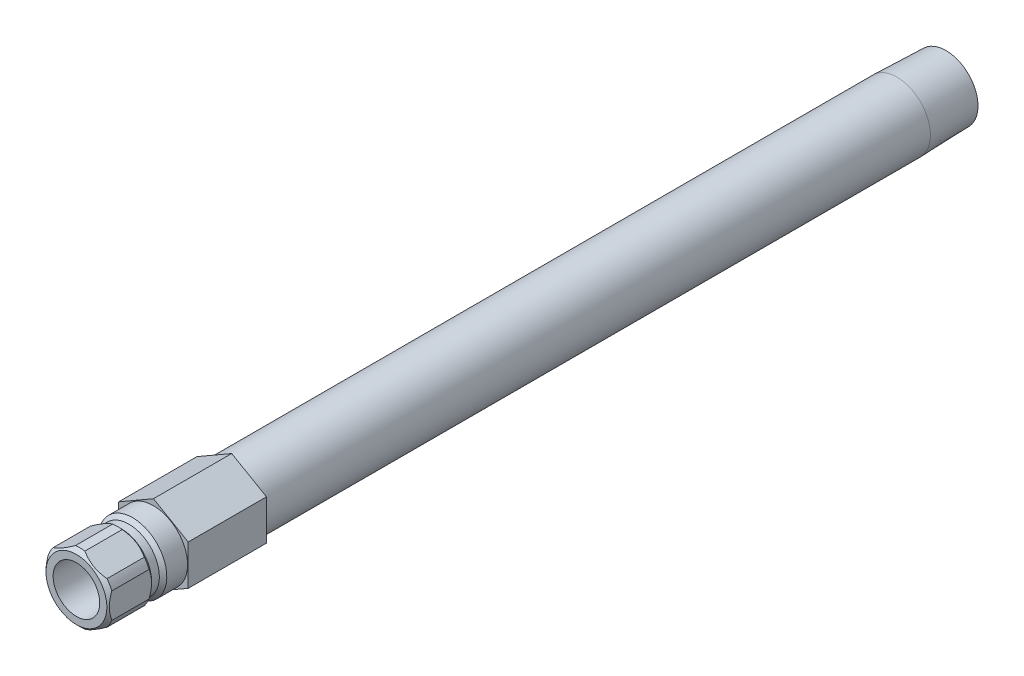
ISO-10303-21;
HEADER;
FILE_DESCRIPTION(('STEP AP214'),'2;1');
FILE_NAME('part.step','',(''),(''),'','','');
FILE_SCHEMA(('AUTOMOTIVE_DESIGN { 1 0 10303 214 1 1 1 1 }'));
ENDSEC;
DATA;
#1=APPLICATION_CONTEXT('core data for automotive mechanical design processes');
#2=APPLICATION_PROTOCOL_DEFINITION('international standard','automotive_design',2000,#1);
#3=PRODUCT_CONTEXT('',#1,'mechanical');
#4=PRODUCT('Part','Part','',(#3));
#5=PRODUCT_RELATED_PRODUCT_CATEGORY('part','',(#4));
#6=PRODUCT_DEFINITION_FORMATION('','',#4);
#7=PRODUCT_DEFINITION_CONTEXT('part definition',#1,'design');
#8=PRODUCT_DEFINITION('design','',#6,#7);
#9=PRODUCT_DEFINITION_SHAPE('','',#8);
#10=(LENGTH_UNIT() NAMED_UNIT(*) SI_UNIT(.MILLI.,.METRE.));
#11=(NAMED_UNIT(*) PLANE_ANGLE_UNIT() SI_UNIT($,.RADIAN.));
#12=(NAMED_UNIT(*) SI_UNIT($,.STERADIAN.) SOLID_ANGLE_UNIT());
#13=UNCERTAINTY_MEASURE_WITH_UNIT(LENGTH_MEASURE(1.E-05),#10,'distance_accuracy_value','');
#14=(GEOMETRIC_REPRESENTATION_CONTEXT(3) GLOBAL_UNCERTAINTY_ASSIGNED_CONTEXT((#13)) GLOBAL_UNIT_ASSIGNED_CONTEXT((#10,
#11,#12)) REPRESENTATION_CONTEXT('',''));
#15=CARTESIAN_POINT('',(0.,0.,0.));
#16=DIRECTION('',(0.,0.,1.));
#17=DIRECTION('',(1.,0.,0.));
#18=AXIS2_PLACEMENT_3D('',#15,#16,#17);
#19=CARTESIAN_POINT('',(0.,0.,12.8748331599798));
#20=DIRECTION('',(0.,0.,-1.));
#21=DIRECTION('',(0.,1.,0.));
#22=AXIS2_PLACEMENT_3D('',#19,#20,#21);
#23=CYLINDRICAL_SURFACE('',#22,6.985);
#24=DIRECTION('',(0.,0.,-1.));
#25=VECTOR('',#24,1.);
#26=CARTESIAN_POINT('',(5.50323442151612,-4.30170151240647,12.8748331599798));
#27=LINE('',#26,#25);
#28=CARTESIAN_POINT('',(5.50323442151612,-4.30170151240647,7.366));
#29=VERTEX_POINT('',#28);
#30=CARTESIAN_POINT('',(5.50323442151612,-4.30170151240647,14.986));
#31=VERTEX_POINT('',#30);
#32=EDGE_CURVE('E452',#29,#31,#27,.F.);
#33=ORIENTED_EDGE('',*,*,#32,.F.);
#34=CARTESIAN_POINT('',(0.,0.,7.366));
#35=DIRECTION('',(0.,0.,-1.));
#36=DIRECTION('',(0.,1.,0.));
#37=AXIS2_PLACEMENT_3D('',#34,#35,#36);
#38=CIRCLE('',#37,6.985);
#39=CARTESIAN_POINT('',(6.477,-2.6150900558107,7.366));
#40=VERTEX_POINT('',#39);
#41=EDGE_CURVE('E190',#40,#29,#38,.T.);
#42=ORIENTED_EDGE('',*,*,#41,.F.);
#43=DIRECTION('',(0.,0.,-1.));
#44=VECTOR('',#43,1.);
#45=CARTESIAN_POINT('',(6.477,-2.6150900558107,12.8748331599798));
#46=LINE('',#45,#44);
#47=CARTESIAN_POINT('',(6.477,-2.6150900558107,14.986));
#48=VERTEX_POINT('',#47);
#49=EDGE_CURVE('E367',#48,#40,#46,.T.);
#50=ORIENTED_EDGE('',*,*,#49,.F.);
#51=CARTESIAN_POINT('',(0.,0.,14.986));
#52=DIRECTION('',(0.,0.,-1.));
#53=DIRECTION('',(0.,1.,0.));
#54=AXIS2_PLACEMENT_3D('',#51,#52,#53);
#55=CIRCLE('',#54,6.985);
#56=EDGE_CURVE('E355',#48,#31,#55,.T.);
#57=ORIENTED_EDGE('',*,*,#56,.T.);
#58=EDGE_LOOP('',(#33,#42,#50,#57));
#59=FACE_BOUND('',#58,.T.);
#60=ADVANCED_FACE('F34',(#59),#23,.T.);
#61=DIRECTION('',(0.,0.,-1.));
#62=VECTOR('',#61,1.);
#63=CARTESIAN_POINT('',(6.477,2.6150900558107,12.8748331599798));
#64=LINE('',#63,#62);
#65=CARTESIAN_POINT('',(6.477,2.6150900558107,7.366));
#66=VERTEX_POINT('',#65);
#67=CARTESIAN_POINT('',(6.477,2.6150900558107,14.986));
#68=VERTEX_POINT('',#67);
#69=EDGE_CURVE('E279',#66,#68,#64,.F.);
#70=ORIENTED_EDGE('',*,*,#69,.F.);
#71=CARTESIAN_POINT('',(5.50323442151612,4.30170151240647,7.366));
#72=VERTEX_POINT('',#71);
#73=EDGE_CURVE('E193',#72,#66,#38,.T.);
#74=ORIENTED_EDGE('',*,*,#73,.F.);
#75=DIRECTION('',(0.,0.,-1.));
#76=VECTOR('',#75,1.);
#77=CARTESIAN_POINT('',(5.50323442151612,4.30170151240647,12.8748331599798));
#78=LINE('',#77,#76);
#79=CARTESIAN_POINT('',(5.50323442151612,4.30170151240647,14.986));
#80=VERTEX_POINT('',#79);
#81=EDGE_CURVE('E351',#80,#72,#78,.T.);
#82=ORIENTED_EDGE('',*,*,#81,.F.);
#83=EDGE_CURVE('E205',#80,#68,#55,.T.);
#84=ORIENTED_EDGE('',*,*,#83,.T.);
#85=EDGE_LOOP('',(#70,#74,#82,#84));
#86=FACE_BOUND('',#85,.T.);
#87=ADVANCED_FACE('F313',(#86),#23,.T.);
#88=DIRECTION('',(0.,0.,-1.));
#89=VECTOR('',#88,1.);
#90=CARTESIAN_POINT('',(0.973765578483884,6.91679156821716,12.8748331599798));
#91=LINE('',#90,#89);
#92=CARTESIAN_POINT('',(0.973765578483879,6.91679156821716,7.366));
#93=VERTEX_POINT('',#92);
#94=CARTESIAN_POINT('',(0.973765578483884,6.91679156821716,14.986));
#95=VERTEX_POINT('',#94);
#96=EDGE_CURVE('E370',#93,#95,#91,.F.);
#97=ORIENTED_EDGE('',*,*,#96,.F.);
#98=CARTESIAN_POINT('',(-0.97376557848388,6.91679156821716,7.366));
#99=VERTEX_POINT('',#98);
#100=EDGE_CURVE('E195',#99,#93,#38,.T.);
#101=ORIENTED_EDGE('',*,*,#100,.F.);
#102=DIRECTION('',(0.,0.,-1.));
#103=VECTOR('',#102,1.);
#104=CARTESIAN_POINT('',(-0.973765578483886,6.91679156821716,12.8748331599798));
#105=LINE('',#104,#103);
#106=CARTESIAN_POINT('',(-0.973765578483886,6.91679156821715,14.986));
#107=VERTEX_POINT('',#106);
#108=EDGE_CURVE('E54',#107,#99,#105,.T.);
#109=ORIENTED_EDGE('',*,*,#108,.F.);
#110=EDGE_CURVE('E201',#107,#95,#55,.T.);
#111=ORIENTED_EDGE('',*,*,#110,.T.);
#112=EDGE_LOOP('',(#97,#101,#109,#111));
#113=FACE_BOUND('',#112,.T.);
#114=ADVANCED_FACE('F318',(#113),#23,.T.);
#115=DIRECTION('',(0.,0.,-1.));
#116=VECTOR('',#115,1.);
#117=CARTESIAN_POINT('',(-5.50323442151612,4.30170151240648,12.8748331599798));
#118=LINE('',#117,#116);
#119=CARTESIAN_POINT('',(-5.50323442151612,4.30170151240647,7.366));
#120=VERTEX_POINT('',#119);
#121=CARTESIAN_POINT('',(-5.50323442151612,4.30170151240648,14.986));
#122=VERTEX_POINT('',#121);
#123=EDGE_CURVE('E349',#120,#122,#118,.F.);
#124=ORIENTED_EDGE('',*,*,#123,.F.);
#125=CARTESIAN_POINT('',(-6.477,2.61509005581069,7.366));
#126=VERTEX_POINT('',#125);
#127=EDGE_CURVE('E194',#126,#120,#38,.T.);
#128=ORIENTED_EDGE('',*,*,#127,.F.);
#129=DIRECTION('',(0.,0.,-1.));
#130=VECTOR('',#129,1.);
#131=CARTESIAN_POINT('',(-6.477,2.61509005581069,12.8748331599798));
#132=LINE('',#131,#130);
#133=CARTESIAN_POINT('',(-6.477,2.61509005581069,14.986));
#134=VERTEX_POINT('',#133);
#135=EDGE_CURVE('E62',#134,#126,#132,.T.);
#136=ORIENTED_EDGE('',*,*,#135,.F.);
#137=EDGE_CURVE('E204',#134,#122,#55,.T.);
#138=ORIENTED_EDGE('',*,*,#137,.T.);
#139=EDGE_LOOP('',(#124,#128,#136,#138));
#140=FACE_BOUND('',#139,.T.);
#141=ADVANCED_FACE('F329',(#140),#23,.T.);
#142=DIRECTION('',(0.,0.,-1.));
#143=VECTOR('',#142,1.);
#144=CARTESIAN_POINT('',(-6.477,-2.61509005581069,12.8748331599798));
#145=LINE('',#144,#143);
#146=CARTESIAN_POINT('',(-6.477,-2.61509005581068,7.366));
#147=VERTEX_POINT('',#146);
#148=CARTESIAN_POINT('',(-6.477,-2.61509005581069,14.986));
#149=VERTEX_POINT('',#148);
#150=EDGE_CURVE('E340',#147,#149,#145,.F.);
#151=ORIENTED_EDGE('',*,*,#150,.F.);
#152=CARTESIAN_POINT('',(-5.50323442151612,-4.30170151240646,7.366));
#153=VERTEX_POINT('',#152);
#154=EDGE_CURVE('E191',#153,#147,#38,.T.);
#155=ORIENTED_EDGE('',*,*,#154,.F.);
#156=DIRECTION('',(0.,0.,-1.));
#157=VECTOR('',#156,1.);
#158=CARTESIAN_POINT('',(-5.50323442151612,-4.30170151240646,12.8748331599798));
#159=LINE('',#158,#157);
#160=CARTESIAN_POINT('',(-5.50323442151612,-4.30170151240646,14.986));
#161=VERTEX_POINT('',#160);
#162=EDGE_CURVE('E168',#161,#153,#159,.T.);
#163=ORIENTED_EDGE('',*,*,#162,.F.);
#164=EDGE_CURVE('E342',#161,#149,#55,.T.);
#165=ORIENTED_EDGE('',*,*,#164,.T.);
#166=EDGE_LOOP('',(#151,#155,#163,#165));
#167=FACE_BOUND('',#166,.T.);
#168=ADVANCED_FACE('F322',(#167),#23,.T.);
#169=CARTESIAN_POINT('',(0.,0.,12.8748331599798));
#170=DIRECTION('',(0.,0.,-1.));
#171=DIRECTION('',(0.,1.,0.));
#172=AXIS2_PLACEMENT_3D('',#169,#170,#171);
#173=CYLINDRICAL_SURFACE('',#172,6.85799999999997);
#174=CARTESIAN_POINT('',(0.,0.,-152.019));
#175=DIRECTION('',(0.,0.,-1.));
#176=DIRECTION('',(0.,1.,0.));
#177=AXIS2_PLACEMENT_3D('',#174,#175,#176);
#178=CIRCLE('',#177,6.85799999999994);
#179=CARTESIAN_POINT('',(0.,6.858,-152.019));
#180=VERTEX_POINT('',#179);
#181=EDGE_CURVE('E520',#180,#180,#178,.T.);
#182=ORIENTED_EDGE('',*,*,#181,.F.);
#183=EDGE_LOOP('',(#182));
#184=FACE_BOUND('',#183,.T.);
#185=CARTESIAN_POINT('',(0.,0.,-16.002));
#186=DIRECTION('',(0.,0.,1.));
#187=DIRECTION('',(1.,0.,0.));
#188=AXIS2_PLACEMENT_3D('',#185,#186,#187);
#189=CIRCLE('',#188,6.85799999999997);
#190=CARTESIAN_POINT('',(6.85799999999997,0.,-16.002));
#191=VERTEX_POINT('',#190);
#192=EDGE_CURVE('E496',#191,#191,#189,.F.);
#193=ORIENTED_EDGE('',*,*,#192,.T.);
#194=EDGE_LOOP('',(#193));
#195=FACE_BOUND('',#194,.T.);
#196=ADVANCED_FACE('F328',(#184,#195),#173,.T.);
#197=CARTESIAN_POINT('',(0.,0.,12.8748331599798));
#198=DIRECTION('',(0.,0.,-1.));
#199=DIRECTION('',(0.,1.,0.));
#200=AXIS2_PLACEMENT_3D('',#197,#198,#199);
#201=CYLINDRICAL_SURFACE('',#200,4.7625);
#202=CARTESIAN_POINT('',(0.,0.,3.556));
#203=DIRECTION('',(0.,0.,-1.));
#204=DIRECTION('',(0.,1.,0.));
#205=AXIS2_PLACEMENT_3D('',#202,#203,#204);
#206=CIRCLE('',#205,4.76249999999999);
#207=CARTESIAN_POINT('',(0.,4.7625,3.556));
#208=VERTEX_POINT('',#207);
#209=EDGE_CURVE('E508',#208,#208,#206,.T.);
#210=ORIENTED_EDGE('',*,*,#209,.T.);
#211=EDGE_LOOP('',(#210));
#212=FACE_BOUND('',#211,.T.);
#213=CARTESIAN_POINT('',(0.,0.,15.748));
#214=DIRECTION('',(0.,0.,-1.));
#215=DIRECTION('',(0.,1.,0.));
#216=AXIS2_PLACEMENT_3D('',#213,#214,#215);
#217=CIRCLE('',#216,4.7625);
#218=CARTESIAN_POINT('',(0.,4.7625,15.748));
#219=VERTEX_POINT('',#218);
#220=EDGE_CURVE('E174',#219,#219,#217,.T.);
#221=ORIENTED_EDGE('',*,*,#220,.F.);
#222=EDGE_LOOP('',(#221));
#223=FACE_BOUND('',#222,.T.);
#224=ADVANCED_FACE('F36',(#212,#223),#201,.F.);
#225=CARTESIAN_POINT('',(0.,4.7625,15.748));
#226=DIRECTION('',(0.,0.,1.));
#227=DIRECTION('',(0.,-1.,0.));
#228=AXIS2_PLACEMENT_3D('',#225,#226,#227);
#229=PLANE('',#228);
#230=ORIENTED_EDGE('',*,*,#220,.T.);
#231=EDGE_LOOP('',(#230));
#232=FACE_BOUND('',#231,.T.);
#233=CARTESIAN_POINT('',(0.,0.,15.748));
#234=DIRECTION('',(0.,0.,-1.));
#235=DIRECTION('',(0.,1.,0.));
#236=AXIS2_PLACEMENT_3D('',#233,#234,#235);
#237=CIRCLE('',#236,6.223);
#238=CARTESIAN_POINT('',(0.,6.223,15.748));
#239=VERTEX_POINT('',#238);
#240=EDGE_CURVE('E206',#239,#239,#237,.T.);
#241=ORIENTED_EDGE('',*,*,#240,.F.);
#242=EDGE_LOOP('',(#241));
#243=FACE_BOUND('',#242,.T.);
#244=ADVANCED_FACE('F241',(#232,#243),#229,.T.);
#245=CARTESIAN_POINT('',(0.,0.,14.986));
#246=DIRECTION('',(0.,0.,-1.));
#247=DIRECTION('',(0.,1.,0.));
#248=AXIS2_PLACEMENT_3D('',#245,#246,#247);
#249=CONICAL_SURFACE('',#248,6.985,0.785398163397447);
#250=CARTESIAN_POINT('',(5.50369701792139,-4.30143443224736,14.9858));
#251=CARTESIAN_POINT('',(5.32269478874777,-4.40593611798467,15.0641166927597));
#252=CARTESIAN_POINT('',(5.13917907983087,-4.51188896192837,15.1353544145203));
#253=CARTESIAN_POINT('',(4.76736839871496,-4.72655395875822,15.2608524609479));
#254=CARTESIAN_POINT('',(4.57906245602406,-4.83527244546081,15.3150691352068));
#255=CARTESIAN_POINT('',(4.20553846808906,-5.05092662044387,15.401724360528));
#256=CARTESIAN_POINT('',(4.02044501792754,-5.15779037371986,15.4348622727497));
#257=CARTESIAN_POINT('',(3.64855359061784,-5.37250198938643,15.4802195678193));
#258=CARTESIAN_POINT('',(3.46175806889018,-5.48034843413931,15.4924653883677));
#259=CARTESIAN_POINT('',(3.08219421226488,-5.69948972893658,15.4953056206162));
#260=CARTESIAN_POINT('',(2.88942157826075,-5.81078706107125,15.4852117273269));
#261=CARTESIAN_POINT('',(2.50551871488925,-6.03243348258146,15.4426708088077));
#262=CARTESIAN_POINT('',(2.31439108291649,-6.14278107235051,15.4101933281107));
#263=CARTESIAN_POINT('',(1.92845877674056,-6.36559919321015,15.3234273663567));
#264=CARTESIAN_POINT('',(1.73378601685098,-6.47799356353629,15.268364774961));
#265=CARTESIAN_POINT('',(1.44558978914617,-6.6443837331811,15.1720079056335));
#266=CARTESIAN_POINT('',(1.35026676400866,-6.69941850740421,15.1376422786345));
#267=CARTESIAN_POINT('',(1.16086120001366,-6.80877186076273,15.0647445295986));
#268=CARTESIAN_POINT('',(1.06677820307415,-6.86309070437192,15.0262139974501));
#269=CARTESIAN_POINT('',(0.973302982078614,-6.91705864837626,14.9858));
#270=B_SPLINE_CURVE_WITH_KNOTS('',3,(#250,#251,#252,#253,#254,#255,#256,#257,#258,#259,#260,
#261,#262,#263,#264,#265,#266,#267,#268,#269),.UNSPECIFIED.,.F.,.F.,(4,2,2,2,2,2,2,2,2,4),(0.,
0.669810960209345,1.34132587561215,1.9892054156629,2.63626449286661,3.30353665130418,
3.97171850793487,4.66502165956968,5.01088265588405,5.35661208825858),.UNSPECIFIED.);
#271=CARTESIAN_POINT('',(0.973765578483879,-6.91679156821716,14.986));
#272=VERTEX_POINT('',#271);
#273=EDGE_CURVE('E451',#31,#272,#270,.T.);
#274=ORIENTED_EDGE('',*,*,#273,.F.);
#275=ORIENTED_EDGE('',*,*,#56,.F.);
#276=CARTESIAN_POINT('',(6.477,-7.50531717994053,12.0573066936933));
#277=CARTESIAN_POINT('',(6.477,-7.32278230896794,12.1954662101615));
#278=CARTESIAN_POINT('',(6.477,-7.13923073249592,12.3323042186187));
#279=CARTESIAN_POINT('',(6.477,-6.76969107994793,12.6027438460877));
#280=CARTESIAN_POINT('',(6.477,-6.58370240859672,12.7363446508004));
#281=CARTESIAN_POINT('',(6.477,-6.20752484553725,13.0006667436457));
#282=CARTESIAN_POINT('',(6.477,-6.01731457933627,13.1313577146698));
#283=CARTESIAN_POINT('',(6.477,-5.63367369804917,13.3879087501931));
#284=CARTESIAN_POINT('',(6.477,-5.44024331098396,13.5137691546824));
#285=CARTESIAN_POINT('',(6.477,-5.03831720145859,13.7667102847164));
#286=CARTESIAN_POINT('',(6.477,-4.8295984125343,13.893438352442));
#287=CARTESIAN_POINT('',(6.477,-4.4072839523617,14.1386241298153));
#288=CARTESIAN_POINT('',(6.477,-4.19368750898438,14.2570805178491));
#289=CARTESIAN_POINT('',(6.477,-3.7616267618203,14.4831715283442));
#290=CARTESIAN_POINT('',(6.477,-3.54317924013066,14.5908379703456));
#291=CARTESIAN_POINT('',(6.477,-3.100295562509,14.7929384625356));
#292=CARTESIAN_POINT('',(6.477,-2.87586219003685,14.8873785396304));
#293=CARTESIAN_POINT('',(6.477,-2.43955826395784,15.0524966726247));
#294=CARTESIAN_POINT('',(6.477,-2.22819339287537,15.1244971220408));
#295=CARTESIAN_POINT('',(6.477,-1.80033354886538,15.2515475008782));
#296=CARTESIAN_POINT('',(6.477,-1.58383822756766,15.3065962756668));
#297=CARTESIAN_POINT('',(6.477,-1.15063390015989,15.3959385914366));
#298=CARTESIAN_POINT('',(6.477,-0.934000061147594,15.4305906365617));
#299=CARTESIAN_POINT('',(6.477,-0.498364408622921,15.4784594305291));
#300=CARTESIAN_POINT('',(6.477,-0.279363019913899,15.4916799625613));
#301=CARTESIAN_POINT('',(6.477,0.150697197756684,15.4956835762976));
#302=CARTESIAN_POINT('',(6.477,0.361748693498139,15.4872823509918));
#303=CARTESIAN_POINT('',(6.477,0.782066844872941,15.4503172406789));
#304=CARTESIAN_POINT('',(6.477,0.991333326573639,15.421751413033));
#305=CARTESIAN_POINT('',(6.477,1.41010575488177,15.3455375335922));
#306=CARTESIAN_POINT('',(6.477,1.6195513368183,15.2975631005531));
#307=CARTESIAN_POINT('',(6.477,2.03387291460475,15.1851046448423));
#308=CARTESIAN_POINT('',(6.477,2.2387492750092,15.1206219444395));
#309=CARTESIAN_POINT('',(6.477,2.66141718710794,14.9715598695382));
#310=CARTESIAN_POINT('',(6.477,2.87875617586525,14.8857103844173));
#311=CARTESIAN_POINT('',(6.477,3.30779766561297,14.7008180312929));
#312=CARTESIAN_POINT('',(6.477,3.51949749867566,14.6017690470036));
#313=CARTESIAN_POINT('',(6.477,3.9382898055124,14.3928329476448));
#314=CARTESIAN_POINT('',(6.477,4.14536521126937,14.282911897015));
#315=CARTESIAN_POINT('',(6.477,4.55475391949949,14.0546596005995));
#316=CARTESIAN_POINT('',(6.477,4.75706796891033,13.93632968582));
#317=CARTESIAN_POINT('',(6.477,5.14761370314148,13.6989609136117));
#318=CARTESIAN_POINT('',(6.477,5.33604552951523,13.580249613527));
#319=CARTESIAN_POINT('',(6.477,5.70967381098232,13.3378251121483));
#320=CARTESIAN_POINT('',(6.477,5.89487001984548,13.2141115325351));
#321=CARTESIAN_POINT('',(6.477,6.26095063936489,12.9635958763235));
#322=CARTESIAN_POINT('',(6.477,6.44185783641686,12.8368269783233));
#323=CARTESIAN_POINT('',(6.477,6.80119835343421,12.5799293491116));
#324=CARTESIAN_POINT('',(6.477,6.97963234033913,12.4498015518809));
#325=CARTESIAN_POINT('',(6.477,7.15703038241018,12.3183002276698));
#326=B_SPLINE_CURVE_WITH_KNOTS('',3,(#276,#277,#278,#279,#280,#281,#282,#283,#284,#285,#286,
#287,#288,#289,#290,#291,#292,#293,#294,#295,#296,#297,#298,#299,#300,#301,#302,#303,#304,#305,
#306,#307,#308,#309,#310,#311,#312,#313,#314,#315,#316,#317,#318,#319,#320,#321,#322,#323,#324,
#325),.UNSPECIFIED.,.F.,.F.,(4,2,2,2,2,2,2,2,2,2,2,2,2,2,2,2,2,2,2,2,2,2,2,2,4),(0.,
0.686790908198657,1.37375281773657,2.06603541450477,2.75826919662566,3.49065471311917,
4.22315698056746,4.95343127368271,5.68337170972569,6.35265989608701,7.02199365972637,
7.67918147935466,8.33625327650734,8.96890298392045,9.6016136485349,10.2454384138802,
10.8892116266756,11.5897073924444,12.2905288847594,12.9936114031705,13.6965828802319,
14.3646145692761,15.0326968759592,15.6953618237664,16.3578444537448),.UNSPECIFIED.);
#327=EDGE_CURVE('E271',#68,#48,#326,.F.);
#328=ORIENTED_EDGE('',*,*,#327,.F.);
#329=ORIENTED_EDGE('',*,*,#83,.F.);
#330=CARTESIAN_POINT('',(0.973302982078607,6.91705864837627,14.9858));
#331=CARTESIAN_POINT('',(1.15430521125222,6.81255696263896,15.0641166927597));
#332=CARTESIAN_POINT('',(1.33782092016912,6.70660411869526,15.1353544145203));
#333=CARTESIAN_POINT('',(1.70963160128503,6.49193912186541,15.2608524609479));
#334=CARTESIAN_POINT('',(1.89793754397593,6.38322063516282,15.3150691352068));
#335=CARTESIAN_POINT('',(2.27146153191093,6.16756646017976,15.401724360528));
#336=CARTESIAN_POINT('',(2.45655498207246,6.06070270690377,15.4348622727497));
#337=CARTESIAN_POINT('',(2.82844640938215,5.8459910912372,15.4802195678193));
#338=CARTESIAN_POINT('',(3.01524193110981,5.73814464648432,15.4924653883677));
#339=CARTESIAN_POINT('',(3.39480578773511,5.51900335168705,15.4953056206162));
#340=CARTESIAN_POINT('',(3.58757842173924,5.40770601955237,15.4852117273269));
#341=CARTESIAN_POINT('',(3.97148128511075,5.18605959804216,15.4426708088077));
#342=CARTESIAN_POINT('',(4.16260891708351,5.07571200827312,15.4101933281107));
#343=CARTESIAN_POINT('',(4.54854122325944,4.85289388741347,15.3234273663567));
#344=CARTESIAN_POINT('',(4.74321398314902,4.74049951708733,15.268364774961));
#345=CARTESIAN_POINT('',(5.03141021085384,4.57410934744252,15.1720079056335));
#346=CARTESIAN_POINT('',(5.12673323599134,4.51907457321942,15.1376422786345));
#347=CARTESIAN_POINT('',(5.31613879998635,4.40972121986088,15.0647445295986));
#348=CARTESIAN_POINT('',(5.41022179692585,4.3554023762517,15.0262139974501));
#349=CARTESIAN_POINT('',(5.50369701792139,4.30143443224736,14.9858));
#350=B_SPLINE_CURVE_WITH_KNOTS('',3,(#330,#331,#332,#333,#334,#335,#336,#337,#338,#339,#340,
#341,#342,#343,#344,#345,#346,#347,#348,#349),.UNSPECIFIED.,.F.,.F.,(4,2,2,2,2,2,2,2,2,4),(0.,
0.669810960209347,1.34132587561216,1.9892054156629,2.63626449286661,3.30353665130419,
3.97171850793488,4.66502165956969,5.01088265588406,5.35661208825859),.UNSPECIFIED.);
#351=EDGE_CURVE('E263',#95,#80,#350,.T.);
#352=ORIENTED_EDGE('',*,*,#351,.F.);
#353=ORIENTED_EDGE('',*,*,#110,.F.);
#354=CARTESIAN_POINT('',(-5.50369701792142,4.30143443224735,14.9858));
#355=CARTESIAN_POINT('',(-5.3226947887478,4.40593611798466,15.0641166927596));
#356=CARTESIAN_POINT('',(-5.1391790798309,4.51188896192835,15.1353544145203));
#357=CARTESIAN_POINT('',(-4.76736839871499,4.72655395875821,15.2608524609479));
#358=CARTESIAN_POINT('',(-4.57906245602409,4.8352724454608,15.3150691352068));
#359=CARTESIAN_POINT('',(-4.20553846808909,5.05092662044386,15.401724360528));
#360=CARTESIAN_POINT('',(-4.02044501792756,5.15779037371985,15.4348622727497));
#361=CARTESIAN_POINT('',(-3.64855359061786,5.37250198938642,15.4802195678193));
#362=CARTESIAN_POINT('',(-3.4617580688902,5.4803484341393,15.4924653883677));
#363=CARTESIAN_POINT('',(-3.0821942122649,5.69948972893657,15.4953056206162));
#364=CARTESIAN_POINT('',(-2.88942157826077,5.81078706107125,15.4852117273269));
#365=CARTESIAN_POINT('',(-2.50551871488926,6.03243348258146,15.4426708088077));
#366=CARTESIAN_POINT('',(-2.3143910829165,6.14278107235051,15.4101933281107));
#367=CARTESIAN_POINT('',(-1.92845877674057,6.36559919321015,15.3234273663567));
#368=CARTESIAN_POINT('',(-1.73378601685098,6.47799356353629,15.268364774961));
#369=CARTESIAN_POINT('',(-1.44558978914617,6.6443837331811,15.1720079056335));
#370=CARTESIAN_POINT('',(-1.35026676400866,6.69941850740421,15.1376422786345));
#371=CARTESIAN_POINT('',(-1.16086120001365,6.80877186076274,15.0647445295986));
#372=CARTESIAN_POINT('',(-1.06677820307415,6.86309070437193,15.0262139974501));
#373=CARTESIAN_POINT('',(-0.97330298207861,6.91705864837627,14.9858));
#374=B_SPLINE_CURVE_WITH_KNOTS('',3,(#354,#355,#356,#357,#358,#359,#360,#361,#362,#363,#364,
#365,#366,#367,#368,#369,#370,#371,#372,#373),.UNSPECIFIED.,.F.,.F.,(4,2,2,2,2,2,2,2,2,4),(0.,
0.66981096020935,1.34132587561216,1.98920541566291,2.63626449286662,3.3035366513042,
3.9717185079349,4.66502165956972,5.01088265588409,5.35661208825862),.UNSPECIFIED.);
#375=EDGE_CURVE('E256',#122,#107,#374,.T.);
#376=ORIENTED_EDGE('',*,*,#375,.F.);
#377=ORIENTED_EDGE('',*,*,#137,.F.);
#378=CARTESIAN_POINT('',(-6.477,-7.50531717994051,12.0573066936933));
#379=CARTESIAN_POINT('',(-6.477,-7.32278230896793,12.1954662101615));
#380=CARTESIAN_POINT('',(-6.477,-7.13923073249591,12.3323042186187));
#381=CARTESIAN_POINT('',(-6.477,-6.76969107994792,12.6027438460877));
#382=CARTESIAN_POINT('',(-6.477,-6.58370240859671,12.7363446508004));
#383=CARTESIAN_POINT('',(-6.477,-6.20752484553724,13.0006667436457));
#384=CARTESIAN_POINT('',(-6.477,-6.01731457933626,13.1313577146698));
#385=CARTESIAN_POINT('',(-6.477,-5.63367369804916,13.3879087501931));
#386=CARTESIAN_POINT('',(-6.477,-5.44024331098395,13.5137691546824));
#387=CARTESIAN_POINT('',(-6.477,-5.03831720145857,13.7667102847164));
#388=CARTESIAN_POINT('',(-6.477,-4.82959841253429,13.8934383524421));
#389=CARTESIAN_POINT('',(-6.477,-4.40728395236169,14.1386241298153));
#390=CARTESIAN_POINT('',(-6.477,-4.19368750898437,14.2570805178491));
#391=CARTESIAN_POINT('',(-6.477,-3.76162676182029,14.4831715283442));
#392=CARTESIAN_POINT('',(-6.477,-3.54317924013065,14.5908379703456));
#393=CARTESIAN_POINT('',(-6.477,-3.10029556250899,14.7929384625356));
#394=CARTESIAN_POINT('',(-6.477,-2.87586219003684,14.8873785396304));
#395=CARTESIAN_POINT('',(-6.477,-2.43955826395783,15.0524966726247));
#396=CARTESIAN_POINT('',(-6.477,-2.22819339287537,15.1244971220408));
#397=CARTESIAN_POINT('',(-6.477,-1.80033354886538,15.2515475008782));
#398=CARTESIAN_POINT('',(-6.477,-1.58383822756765,15.3065962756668));
#399=CARTESIAN_POINT('',(-6.477,-1.15063390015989,15.3959385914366));
#400=CARTESIAN_POINT('',(-6.477,-0.934000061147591,15.4305906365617));
#401=CARTESIAN_POINT('',(-6.477,-0.49836440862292,15.4784594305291));
#402=CARTESIAN_POINT('',(-6.477,-0.279363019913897,15.4916799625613));
#403=CARTESIAN_POINT('',(-6.477,0.150697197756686,15.4956835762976));
#404=CARTESIAN_POINT('',(-6.477,0.361748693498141,15.4872823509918));
#405=CARTESIAN_POINT('',(-6.477,0.782066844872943,15.4503172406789));
#406=CARTESIAN_POINT('',(-6.477,0.991333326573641,15.421751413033));
#407=CARTESIAN_POINT('',(-6.477,1.41010575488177,15.3455375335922));
#408=CARTESIAN_POINT('',(-6.477,1.6195513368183,15.2975631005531));
#409=CARTESIAN_POINT('',(-6.477,2.03387291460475,15.1851046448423));
#410=CARTESIAN_POINT('',(-6.477,2.2387492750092,15.1206219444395));
#411=CARTESIAN_POINT('',(-6.477,2.66141718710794,14.9715598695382));
#412=CARTESIAN_POINT('',(-6.477,2.87875617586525,14.8857103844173));
#413=CARTESIAN_POINT('',(-6.477,3.30779766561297,14.7008180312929));
#414=CARTESIAN_POINT('',(-6.477,3.51949749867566,14.6017690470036));
#415=CARTESIAN_POINT('',(-6.477,3.93828980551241,14.3928329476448));
#416=CARTESIAN_POINT('',(-6.477,4.14536521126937,14.282911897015));
#417=CARTESIAN_POINT('',(-6.477,4.55475391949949,14.0546596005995));
#418=CARTESIAN_POINT('',(-6.477,4.75706796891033,13.93632968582));
#419=CARTESIAN_POINT('',(-6.477,5.14761370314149,13.6989609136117));
#420=CARTESIAN_POINT('',(-6.477,5.33604552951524,13.580249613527));
#421=CARTESIAN_POINT('',(-6.477,5.70967381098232,13.3378251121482));
#422=CARTESIAN_POINT('',(-6.477,5.89487001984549,13.2141115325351));
#423=CARTESIAN_POINT('',(-6.477,6.2609506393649,12.9635958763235));
#424=CARTESIAN_POINT('',(-6.477,6.44185783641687,12.8368269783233));
#425=CARTESIAN_POINT('',(-6.477,6.80119835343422,12.5799293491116));
#426=CARTESIAN_POINT('',(-6.477,6.97963234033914,12.4498015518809));
#427=CARTESIAN_POINT('',(-6.477,7.15703038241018,12.3183002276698));
#428=B_SPLINE_CURVE_WITH_KNOTS('',3,(#378,#379,#380,#381,#382,#383,#384,#385,#386,#387,#388,
#389,#390,#391,#392,#393,#394,#395,#396,#397,#398,#399,#400,#401,#402,#403,#404,#405,#406,#407,
#408,#409,#410,#411,#412,#413,#414,#415,#416,#417,#418,#419,#420,#421,#422,#423,#424,#425,#426,
#427),.UNSPECIFIED.,.F.,.F.,(4,2,2,2,2,2,2,2,2,2,2,2,2,2,2,2,2,2,2,2,2,2,2,2,4),(0.,
0.686790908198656,1.37375281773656,2.06603541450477,2.75826919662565,3.49065471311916,
4.22315698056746,4.9534312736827,5.68337170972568,6.352659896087,7.02199365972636,
7.67918147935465,8.33625327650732,8.96890298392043,9.60161364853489,10.2454384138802,
10.8892116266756,11.5897073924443,12.2905288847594,12.9936114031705,13.6965828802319,
14.3646145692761,15.0326968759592,15.6953618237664,16.3578444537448),.UNSPECIFIED.);
#429=EDGE_CURVE('E249',#149,#134,#428,.T.);
#430=ORIENTED_EDGE('',*,*,#429,.F.);
#431=ORIENTED_EDGE('',*,*,#164,.F.);
#432=CARTESIAN_POINT('',(-0.973302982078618,-6.91705864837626,14.9858));
#433=CARTESIAN_POINT('',(-1.15430521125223,-6.81255696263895,15.0641166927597));
#434=CARTESIAN_POINT('',(-1.33782092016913,-6.70660411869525,15.1353544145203));
#435=CARTESIAN_POINT('',(-1.70963160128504,-6.49193912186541,15.2608524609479));
#436=CARTESIAN_POINT('',(-1.89793754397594,-6.38322063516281,15.3150691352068));
#437=CARTESIAN_POINT('',(-2.27146153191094,-6.16756646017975,15.401724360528));
#438=CARTESIAN_POINT('',(-2.45655498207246,-6.06070270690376,15.4348622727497));
#439=CARTESIAN_POINT('',(-2.82844640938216,-5.84599109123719,15.4802195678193));
#440=CARTESIAN_POINT('',(-3.01524193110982,-5.73814464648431,15.4924653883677));
#441=CARTESIAN_POINT('',(-3.39480578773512,-5.51900335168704,15.4953056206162));
#442=CARTESIAN_POINT('',(-3.58757842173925,-5.40770601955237,15.4852117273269));
#443=CARTESIAN_POINT('',(-3.97148128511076,-5.18605959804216,15.4426708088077));
#444=CARTESIAN_POINT('',(-4.16260891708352,-5.07571200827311,15.4101933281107));
#445=CARTESIAN_POINT('',(-4.54854122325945,-4.85289388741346,15.3234273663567));
#446=CARTESIAN_POINT('',(-4.74321398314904,-4.74049951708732,15.268364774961));
#447=CARTESIAN_POINT('',(-5.03141021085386,-4.57410934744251,15.1720079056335));
#448=CARTESIAN_POINT('',(-5.12673323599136,-4.5190745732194,15.1376422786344));
#449=CARTESIAN_POINT('',(-5.31613879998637,-4.40972121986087,15.0647445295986));
#450=CARTESIAN_POINT('',(-5.41022179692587,-4.35540237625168,15.0262139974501));
#451=CARTESIAN_POINT('',(-5.50369701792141,-4.30143443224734,14.9858));
#452=B_SPLINE_CURVE_WITH_KNOTS('',3,(#432,#433,#434,#435,#436,#437,#438,#439,#440,#441,#442,
#443,#444,#445,#446,#447,#448,#449,#450,#451),.UNSPECIFIED.,.F.,.F.,(4,2,2,2,2,2,2,2,2,4),(0.,
0.669810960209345,1.34132587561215,1.9892054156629,2.6362644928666,3.30353665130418,
3.97171850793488,4.6650216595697,5.01088265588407,5.35661208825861),.UNSPECIFIED.);
#453=CARTESIAN_POINT('',(-0.973765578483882,-6.91679156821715,14.986));
#454=VERTEX_POINT('',#453);
#455=EDGE_CURVE('E184',#454,#161,#452,.T.);
#456=ORIENTED_EDGE('',*,*,#455,.F.);
#457=EDGE_CURVE('E183',#272,#454,#55,.T.);
#458=ORIENTED_EDGE('',*,*,#457,.F.);
#459=EDGE_LOOP('',(#274,#275,#328,#329,#352,#353,#376,#377,#430,#431,#456,#458));
#460=FACE_BOUND('',#459,.T.);
#461=ORIENTED_EDGE('',*,*,#240,.T.);
#462=EDGE_LOOP('',(#461));
#463=FACE_BOUND('',#462,.T.);
#464=ADVANCED_FACE('F238',(#460,#463),#249,.T.);
#465=DIRECTION('',(0.,0.,-1.));
#466=VECTOR('',#465,1.);
#467=CARTESIAN_POINT('',(0.973765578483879,-6.91679156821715,12.8748331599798));
#468=LINE('',#467,#466);
#469=CARTESIAN_POINT('',(0.973765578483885,-6.91679156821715,7.366));
#470=VERTEX_POINT('',#469);
#471=EDGE_CURVE('E278',#272,#470,#468,.T.);
#472=ORIENTED_EDGE('',*,*,#471,.F.);
#473=ORIENTED_EDGE('',*,*,#457,.T.);
#474=DIRECTION('',(0.,0.,-1.));
#475=VECTOR('',#474,1.);
#476=CARTESIAN_POINT('',(-0.973765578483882,-6.91679156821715,12.8748331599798));
#477=LINE('',#476,#475);
#478=CARTESIAN_POINT('',(-0.973765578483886,-6.91679156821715,7.366));
#479=VERTEX_POINT('',#478);
#480=EDGE_CURVE('E165',#479,#454,#477,.F.);
#481=ORIENTED_EDGE('',*,*,#480,.F.);
#482=EDGE_CURVE('E181',#470,#479,#38,.T.);
#483=ORIENTED_EDGE('',*,*,#482,.F.);
#484=EDGE_LOOP('',(#472,#473,#481,#483));
#485=FACE_BOUND('',#484,.T.);
#486=ADVANCED_FACE('F180',(#485),#23,.T.);
#487=CARTESIAN_POINT('',(0.,0.,6.604));
#488=DIRECTION('',(0.,0.,1.));
#489=DIRECTION('',(0.,-1.,0.));
#490=AXIS2_PLACEMENT_3D('',#487,#488,#489);
#491=CONICAL_SURFACE('',#490,6.223,0.785398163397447);
#492=CARTESIAN_POINT('',(0.973302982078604,-6.91705864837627,7.3662));
#493=CARTESIAN_POINT('',(1.15430521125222,-6.81255696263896,7.28788330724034));
#494=CARTESIAN_POINT('',(1.33782092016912,-6.70660411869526,7.21664558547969));
#495=CARTESIAN_POINT('',(1.70963160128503,-6.49193912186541,7.09114753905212));
#496=CARTESIAN_POINT('',(1.89793754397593,-6.38322063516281,7.03693086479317));
#497=CARTESIAN_POINT('',(2.27146153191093,-6.16756646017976,6.95027563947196));
#498=CARTESIAN_POINT('',(2.45655498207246,-6.06070270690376,6.91713772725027));
#499=CARTESIAN_POINT('',(2.82844640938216,-5.8459910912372,6.87178043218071));
#500=CARTESIAN_POINT('',(3.01524193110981,-5.73814464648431,6.85953461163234));
#501=CARTESIAN_POINT('',(3.39480578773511,-5.51900335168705,6.85669437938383));
#502=CARTESIAN_POINT('',(3.58757842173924,-5.40770601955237,6.86678827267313));
#503=CARTESIAN_POINT('',(3.97148128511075,-5.18605959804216,6.9093291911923));
#504=CARTESIAN_POINT('',(4.16260891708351,-5.07571200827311,6.9418066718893));
#505=CARTESIAN_POINT('',(4.54854122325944,-4.85289388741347,7.02857263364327));
#506=CARTESIAN_POINT('',(4.74321398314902,-4.74049951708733,7.08363522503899));
#507=CARTESIAN_POINT('',(5.03141021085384,-4.57410934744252,7.17999209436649));
#508=CARTESIAN_POINT('',(5.12673323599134,-4.51907457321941,7.21435772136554));
#509=CARTESIAN_POINT('',(5.31613879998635,-4.40972121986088,7.28725547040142));
#510=CARTESIAN_POINT('',(5.41022179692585,-4.35540237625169,7.32578600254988));
#511=CARTESIAN_POINT('',(5.50369701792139,-4.30143443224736,7.3662));
#512=B_SPLINE_CURVE_WITH_KNOTS('',3,(#492,#493,#494,#495,#496,#497,#498,#499,#500,#501,#502,
#503,#504,#505,#506,#507,#508,#509,#510,#511),.UNSPECIFIED.,.F.,.F.,(4,2,2,2,2,2,2,2,2,4),(0.,
0.669810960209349,1.34132587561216,1.9892054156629,2.63626449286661,3.30353665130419,
3.97171850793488,4.6650216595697,5.01088265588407,5.3566120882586),.UNSPECIFIED.);
#513=EDGE_CURVE('E12',#470,#29,#512,.T.);
#514=ORIENTED_EDGE('',*,*,#513,.F.);
#515=ORIENTED_EDGE('',*,*,#482,.T.);
#516=CARTESIAN_POINT('',(-5.50369701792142,-4.30143443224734,7.36620000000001));
#517=CARTESIAN_POINT('',(-5.32269478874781,-4.40593611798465,7.28788330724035));
#518=CARTESIAN_POINT('',(-5.13917907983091,-4.51188896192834,7.2166455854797));
#519=CARTESIAN_POINT('',(-4.767368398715,-4.7265539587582,7.09114753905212));
#520=CARTESIAN_POINT('',(-4.57906245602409,-4.83527244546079,7.03693086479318));
#521=CARTESIAN_POINT('',(-4.20553846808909,-5.05092662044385,6.95027563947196));
#522=CARTESIAN_POINT('',(-4.02044501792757,-5.15779037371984,6.91713772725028));
#523=CARTESIAN_POINT('',(-3.64855359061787,-5.37250198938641,6.87178043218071));
#524=CARTESIAN_POINT('',(-3.46175806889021,-5.48034843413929,6.85953461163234));
#525=CARTESIAN_POINT('',(-3.08219421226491,-5.69948972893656,6.85669437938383));
#526=CARTESIAN_POINT('',(-2.88942157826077,-5.81078706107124,6.86678827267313));
#527=CARTESIAN_POINT('',(-2.50551871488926,-6.03243348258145,6.9093291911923));
#528=CARTESIAN_POINT('',(-2.3143910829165,-6.1427810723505,6.9418066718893));
#529=CARTESIAN_POINT('',(-1.92845877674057,-6.36559919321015,7.02857263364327));
#530=CARTESIAN_POINT('',(-1.73378601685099,-6.47799356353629,7.08363522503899));
#531=CARTESIAN_POINT('',(-1.44558978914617,-6.6443837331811,7.17999209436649));
#532=CARTESIAN_POINT('',(-1.35026676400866,-6.69941850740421,7.21435772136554));
#533=CARTESIAN_POINT('',(-1.16086120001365,-6.80877186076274,7.28725547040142));
#534=CARTESIAN_POINT('',(-1.06677820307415,-6.86309070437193,7.32578600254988));
#535=CARTESIAN_POINT('',(-0.97330298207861,-6.91705864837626,7.3662));
#536=B_SPLINE_CURVE_WITH_KNOTS('',3,(#516,#517,#518,#519,#520,#521,#522,#523,#524,#525,#526,
#527,#528,#529,#530,#531,#532,#533,#534,#535),.UNSPECIFIED.,.F.,.F.,(4,2,2,2,2,2,2,2,2,4),(0.,
0.669810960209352,1.34132587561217,1.98920541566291,2.63626449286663,3.30353665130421,
3.9717185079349,4.66502165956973,5.0108826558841,5.35661208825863),.UNSPECIFIED.);
#537=EDGE_CURVE('E162',#153,#479,#536,.T.);
#538=ORIENTED_EDGE('',*,*,#537,.F.);
#539=ORIENTED_EDGE('',*,*,#154,.T.);
#540=CARTESIAN_POINT('',(-6.477,-7.50531717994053,10.2946933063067));
#541=CARTESIAN_POINT('',(-6.477,-7.32278230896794,10.1565337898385));
#542=CARTESIAN_POINT('',(-6.477,-7.13923073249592,10.0196957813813));
#543=CARTESIAN_POINT('',(-6.477,-6.76969107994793,9.74925615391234));
#544=CARTESIAN_POINT('',(-6.477,-6.58370240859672,9.61565534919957));
#545=CARTESIAN_POINT('',(-6.477,-6.20752484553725,9.35133325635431));
#546=CARTESIAN_POINT('',(-6.477,-6.01731457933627,9.22064228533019));
#547=CARTESIAN_POINT('',(-6.477,-5.63367369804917,8.96409124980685));
#548=CARTESIAN_POINT('',(-6.477,-5.44024331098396,8.83823084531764));
#549=CARTESIAN_POINT('',(-6.477,-5.03831720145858,8.58528971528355));
#550=CARTESIAN_POINT('',(-6.477,-4.8295984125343,8.45856164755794));
#551=CARTESIAN_POINT('',(-6.477,-4.4072839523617,8.21337587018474));
#552=CARTESIAN_POINT('',(-6.477,-4.19368750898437,8.09491948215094));
#553=CARTESIAN_POINT('',(-6.477,-3.7616267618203,7.8688284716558));
#554=CARTESIAN_POINT('',(-6.477,-3.54317924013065,7.76116202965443));
#555=CARTESIAN_POINT('',(-6.477,-3.100295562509,7.55906153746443));
#556=CARTESIAN_POINT('',(-6.477,-2.87586219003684,7.46462146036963));
#557=CARTESIAN_POINT('',(-6.477,-2.43955826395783,7.2995033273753));
#558=CARTESIAN_POINT('',(-6.477,-2.22819339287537,7.2275028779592));
#559=CARTESIAN_POINT('',(-6.477,-1.80033354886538,7.1004524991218));
#560=CARTESIAN_POINT('',(-6.477,-1.58383822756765,7.0454037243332));
#561=CARTESIAN_POINT('',(-6.477,-1.15063390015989,6.95606140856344));
#562=CARTESIAN_POINT('',(-6.477,-0.934000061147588,6.9214093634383));
#563=CARTESIAN_POINT('',(-6.477,-0.498364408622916,6.87354056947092));
#564=CARTESIAN_POINT('',(-6.477,-0.279363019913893,6.86032003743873));
#565=CARTESIAN_POINT('',(-6.477,0.15069719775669,6.85631642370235));
#566=CARTESIAN_POINT('',(-6.477,0.361748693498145,6.86471764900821));
#567=CARTESIAN_POINT('',(-6.477,0.782066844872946,6.90168275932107));
#568=CARTESIAN_POINT('',(-6.477,0.991333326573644,6.93024858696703));
#569=CARTESIAN_POINT('',(-6.477,1.41010575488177,7.00646246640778));
#570=CARTESIAN_POINT('',(-6.477,1.61955133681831,7.05443689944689));
#571=CARTESIAN_POINT('',(-6.477,2.03387291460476,7.16689535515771));
#572=CARTESIAN_POINT('',(-6.477,2.23874927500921,7.2313780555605));
#573=CARTESIAN_POINT('',(-6.477,2.66141718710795,7.38044013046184));
#574=CARTESIAN_POINT('',(-6.477,2.87875617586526,7.46628961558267));
#575=CARTESIAN_POINT('',(-6.477,3.30779766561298,7.65118196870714));
#576=CARTESIAN_POINT('',(-6.477,3.51949749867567,7.75023095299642));
#577=CARTESIAN_POINT('',(-6.477,3.93828980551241,7.95916705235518));
#578=CARTESIAN_POINT('',(-6.477,4.14536521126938,8.06908810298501));
#579=CARTESIAN_POINT('',(-6.477,4.5547539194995,8.2973403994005));
#580=CARTESIAN_POINT('',(-6.477,4.75706796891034,8.41567031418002));
#581=CARTESIAN_POINT('',(-6.477,5.1476137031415,8.65303908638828));
#582=CARTESIAN_POINT('',(-6.477,5.33604552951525,8.77175038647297));
#583=CARTESIAN_POINT('',(-6.477,5.70967381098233,9.01417488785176));
#584=CARTESIAN_POINT('',(-6.477,5.8948700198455,9.13788846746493));
#585=CARTESIAN_POINT('',(-6.477,6.26095063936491,9.38840412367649));
#586=CARTESIAN_POINT('',(-6.477,6.44185783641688,9.51517302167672));
#587=CARTESIAN_POINT('',(-6.477,6.80119835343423,9.7720706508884));
#588=CARTESIAN_POINT('',(-6.477,6.97963234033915,9.90219844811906));
#589=CARTESIAN_POINT('',(-6.477,7.1570303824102,10.0336997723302));
#590=B_SPLINE_CURVE_WITH_KNOTS('',3,(#540,#541,#542,#543,#544,#545,#546,#547,#548,#549,#550,
#551,#552,#553,#554,#555,#556,#557,#558,#559,#560,#561,#562,#563,#564,#565,#566,#567,#568,#569,
#570,#571,#572,#573,#574,#575,#576,#577,#578,#579,#580,#581,#582,#583,#584,#585,#586,#587,#588,
#589),.UNSPECIFIED.,.F.,.F.,(4,2,2,2,2,2,2,2,2,2,2,2,2,2,2,2,2,2,2,2,2,2,2,2,4),(0.,
0.68679090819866,1.37375281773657,2.06603541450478,2.75826919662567,3.49065471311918,
4.22315698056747,4.95343127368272,5.68337170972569,6.35265989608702,7.02199365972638,
7.67918147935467,8.33625327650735,8.96890298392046,9.60161364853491,10.2454384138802,
10.8892116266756,11.5897073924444,12.2905288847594,12.9936114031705,13.6965828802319,
14.3646145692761,15.0326968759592,15.6953618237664,16.3578444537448),.UNSPECIFIED.);
#591=EDGE_CURVE('E173',#126,#147,#590,.F.);
#592=ORIENTED_EDGE('',*,*,#591,.F.);
#593=ORIENTED_EDGE('',*,*,#127,.T.);
#594=CARTESIAN_POINT('',(-0.97330298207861,6.91705864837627,7.3662));
#595=CARTESIAN_POINT('',(-1.15430521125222,6.81255696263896,7.28788330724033));
#596=CARTESIAN_POINT('',(-1.33782092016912,6.70660411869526,7.21664558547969));
#597=CARTESIAN_POINT('',(-1.70963160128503,6.49193912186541,7.09114753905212));
#598=CARTESIAN_POINT('',(-1.89793754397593,6.38322063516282,7.03693086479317));
#599=CARTESIAN_POINT('',(-2.27146153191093,6.16756646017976,6.95027563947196));
#600=CARTESIAN_POINT('',(-2.45655498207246,6.06070270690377,6.91713772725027));
#601=CARTESIAN_POINT('',(-2.82844640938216,5.8459910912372,6.87178043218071));
#602=CARTESIAN_POINT('',(-3.01524193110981,5.73814464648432,6.85953461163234));
#603=CARTESIAN_POINT('',(-3.39480578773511,5.51900335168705,6.85669437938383));
#604=CARTESIAN_POINT('',(-3.58757842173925,5.40770601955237,6.86678827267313));
#605=CARTESIAN_POINT('',(-3.97148128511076,5.18605959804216,6.9093291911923));
#606=CARTESIAN_POINT('',(-4.16260891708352,5.07571200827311,6.9418066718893));
#607=CARTESIAN_POINT('',(-4.54854122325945,4.85289388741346,7.02857263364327));
#608=CARTESIAN_POINT('',(-4.74321398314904,4.74049951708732,7.083635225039));
#609=CARTESIAN_POINT('',(-5.03141021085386,4.57410934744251,7.1799920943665));
#610=CARTESIAN_POINT('',(-5.12673323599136,4.51907457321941,7.21435772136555));
#611=CARTESIAN_POINT('',(-5.31613879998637,4.40972121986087,7.28725547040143));
#612=CARTESIAN_POINT('',(-5.41022179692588,4.35540237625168,7.32578600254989));
#613=CARTESIAN_POINT('',(-5.50369701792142,4.30143443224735,7.36620000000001));
#614=B_SPLINE_CURVE_WITH_KNOTS('',3,(#594,#595,#596,#597,#598,#599,#600,#601,#602,#603,#604,
#605,#606,#607,#608,#609,#610,#611,#612,#613),.UNSPECIFIED.,.F.,.F.,(4,2,2,2,2,2,2,2,2,4),(0.,
0.669810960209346,1.34132587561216,1.9892054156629,2.63626449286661,3.30353665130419,
3.97171850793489,4.66502165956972,5.01088265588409,5.35661208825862),.UNSPECIFIED.);
#615=EDGE_CURVE('E299',#99,#120,#614,.T.);
#616=ORIENTED_EDGE('',*,*,#615,.F.);
#617=ORIENTED_EDGE('',*,*,#100,.T.);
#618=CARTESIAN_POINT('',(5.50369701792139,4.30143443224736,7.3662));
#619=CARTESIAN_POINT('',(5.32269478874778,4.40593611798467,7.28788330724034));
#620=CARTESIAN_POINT('',(5.13917907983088,4.51188896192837,7.21664558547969));
#621=CARTESIAN_POINT('',(4.76736839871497,4.72655395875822,7.09114753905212));
#622=CARTESIAN_POINT('',(4.57906245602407,4.83527244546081,7.03693086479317));
#623=CARTESIAN_POINT('',(4.20553846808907,5.05092662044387,6.95027563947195));
#624=CARTESIAN_POINT('',(4.02044501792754,5.15779037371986,6.91713772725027));
#625=CARTESIAN_POINT('',(3.64855359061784,5.37250198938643,6.87178043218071));
#626=CARTESIAN_POINT('',(3.46175806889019,5.48034843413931,6.85953461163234));
#627=CARTESIAN_POINT('',(3.08219421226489,5.69948972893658,6.85669437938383));
#628=CARTESIAN_POINT('',(2.88942157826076,5.81078706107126,6.86678827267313));
#629=CARTESIAN_POINT('',(2.50551871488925,6.03243348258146,6.9093291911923));
#630=CARTESIAN_POINT('',(2.31439108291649,6.14278107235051,6.9418066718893));
#631=CARTESIAN_POINT('',(1.92845877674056,6.36559919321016,7.02857263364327));
#632=CARTESIAN_POINT('',(1.73378601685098,6.4779935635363,7.08363522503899));
#633=CARTESIAN_POINT('',(1.44558978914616,6.64438373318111,7.17999209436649));
#634=CARTESIAN_POINT('',(1.35026676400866,6.69941850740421,7.21435772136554));
#635=CARTESIAN_POINT('',(1.16086120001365,6.80877186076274,7.28725547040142));
#636=CARTESIAN_POINT('',(1.06677820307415,6.86309070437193,7.32578600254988));
#637=CARTESIAN_POINT('',(0.973302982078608,6.91705864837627,7.3662));
#638=B_SPLINE_CURVE_WITH_KNOTS('',3,(#618,#619,#620,#621,#622,#623,#624,#625,#626,#627,#628,
#629,#630,#631,#632,#633,#634,#635,#636,#637),.UNSPECIFIED.,.F.,.F.,(4,2,2,2,2,2,2,2,2,4),(0.,
0.669810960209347,1.34132587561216,1.9892054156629,2.63626449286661,3.30353665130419,
3.97171850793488,4.66502165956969,5.01088265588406,5.35661208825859),.UNSPECIFIED.);
#639=EDGE_CURVE('E295',#72,#93,#638,.T.);
#640=ORIENTED_EDGE('',*,*,#639,.F.);
#641=ORIENTED_EDGE('',*,*,#73,.T.);
#642=CARTESIAN_POINT('',(6.477,-7.50531717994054,10.2946933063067));
#643=CARTESIAN_POINT('',(6.477,-7.32278230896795,10.1565337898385));
#644=CARTESIAN_POINT('',(6.477,-7.13923073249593,10.0196957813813));
#645=CARTESIAN_POINT('',(6.477,-6.76969107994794,9.74925615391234));
#646=CARTESIAN_POINT('',(6.477,-6.58370240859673,9.61565534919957));
#647=CARTESIAN_POINT('',(6.477,-6.20752484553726,9.35133325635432));
#648=CARTESIAN_POINT('',(6.477,-6.01731457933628,9.22064228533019));
#649=CARTESIAN_POINT('',(6.477,-5.63367369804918,8.96409124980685));
#650=CARTESIAN_POINT('',(6.477,-5.44024331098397,8.83823084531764));
#651=CARTESIAN_POINT('',(6.477,-5.03831720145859,8.58528971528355));
#652=CARTESIAN_POINT('',(6.477,-4.82959841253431,8.45856164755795));
#653=CARTESIAN_POINT('',(6.477,-4.4072839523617,8.21337587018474));
#654=CARTESIAN_POINT('',(6.477,-4.19368750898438,8.09491948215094));
#655=CARTESIAN_POINT('',(6.477,-3.76162676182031,7.8688284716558));
#656=CARTESIAN_POINT('',(6.477,-3.54317924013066,7.76116202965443));
#657=CARTESIAN_POINT('',(6.477,-3.100295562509,7.55906153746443));
#658=CARTESIAN_POINT('',(6.477,-2.87586219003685,7.46462146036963));
#659=CARTESIAN_POINT('',(6.477,-2.43955826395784,7.2995033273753));
#660=CARTESIAN_POINT('',(6.477,-2.22819339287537,7.2275028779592));
#661=CARTESIAN_POINT('',(6.477,-1.80033354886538,7.10045249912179));
#662=CARTESIAN_POINT('',(6.477,-1.58383822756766,7.0454037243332));
#663=CARTESIAN_POINT('',(6.477,-1.15063390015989,6.95606140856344));
#664=CARTESIAN_POINT('',(6.477,-0.934000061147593,6.92140936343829));
#665=CARTESIAN_POINT('',(6.477,-0.498364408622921,6.87354056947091));
#666=CARTESIAN_POINT('',(6.477,-0.279363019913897,6.86032003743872));
#667=CARTESIAN_POINT('',(6.477,0.150697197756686,6.85631642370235));
#668=CARTESIAN_POINT('',(6.477,0.361748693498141,6.8647176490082));
#669=CARTESIAN_POINT('',(6.477,0.782066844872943,6.90168275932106));
#670=CARTESIAN_POINT('',(6.477,0.991333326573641,6.93024858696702));
#671=CARTESIAN_POINT('',(6.477,1.41010575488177,7.00646246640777));
#672=CARTESIAN_POINT('',(6.477,1.6195513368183,7.05443689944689));
#673=CARTESIAN_POINT('',(6.477,2.03387291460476,7.16689535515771));
#674=CARTESIAN_POINT('',(6.477,2.23874927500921,7.2313780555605));
#675=CARTESIAN_POINT('',(6.477,2.66141718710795,7.38044013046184));
#676=CARTESIAN_POINT('',(6.477,2.87875617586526,7.46628961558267));
#677=CARTESIAN_POINT('',(6.477,3.30779766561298,7.65118196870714));
#678=CARTESIAN_POINT('',(6.477,3.51949749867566,7.75023095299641));
#679=CARTESIAN_POINT('',(6.477,3.93828980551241,7.95916705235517));
#680=CARTESIAN_POINT('',(6.477,4.14536521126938,8.06908810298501));
#681=CARTESIAN_POINT('',(6.477,4.55475391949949,8.29734039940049));
#682=CARTESIAN_POINT('',(6.477,4.75706796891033,8.41567031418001));
#683=CARTESIAN_POINT('',(6.477,5.14761370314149,8.65303908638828));
#684=CARTESIAN_POINT('',(6.477,5.33604552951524,8.77175038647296));
#685=CARTESIAN_POINT('',(6.477,5.70967381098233,9.01417488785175));
#686=CARTESIAN_POINT('',(6.477,5.89487001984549,9.13788846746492));
#687=CARTESIAN_POINT('',(6.477,6.2609506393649,9.38840412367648));
#688=CARTESIAN_POINT('',(6.477,6.44185783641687,9.51517302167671));
#689=CARTESIAN_POINT('',(6.477,6.80119835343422,9.77207065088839));
#690=CARTESIAN_POINT('',(6.477,6.97963234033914,9.90219844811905));
#691=CARTESIAN_POINT('',(6.477,7.15703038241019,10.0336997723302));
#692=B_SPLINE_CURVE_WITH_KNOTS('',3,(#642,#643,#644,#645,#646,#647,#648,#649,#650,#651,#652,
#653,#654,#655,#656,#657,#658,#659,#660,#661,#662,#663,#664,#665,#666,#667,#668,#669,#670,#671,
#672,#673,#674,#675,#676,#677,#678,#679,#680,#681,#682,#683,#684,#685,#686,#687,#688,#689,#690,
#691),.UNSPECIFIED.,.F.,.F.,(4,2,2,2,2,2,2,2,2,2,2,2,2,2,2,2,2,2,2,2,2,2,2,2,4),(0.,
0.686790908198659,1.37375281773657,2.06603541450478,2.75826919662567,3.49065471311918,
4.22315698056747,4.95343127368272,5.6833717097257,6.35265989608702,7.02199365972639,
7.67918147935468,8.33625327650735,8.96890298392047,9.60161364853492,10.2454384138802,
10.8892116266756,11.5897073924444,12.2905288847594,12.9936114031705,13.6965828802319,
14.3646145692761,15.0326968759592,15.6953618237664,16.3578444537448),.UNSPECIFIED.);
#693=EDGE_CURVE('E47',#40,#66,#692,.T.);
#694=ORIENTED_EDGE('',*,*,#693,.F.);
#695=ORIENTED_EDGE('',*,*,#41,.T.);
#696=EDGE_LOOP('',(#514,#515,#538,#539,#592,#593,#616,#617,#640,#641,#694,#695));
#697=FACE_BOUND('',#696,.T.);
#698=CARTESIAN_POINT('',(0.,0.,6.604));
#699=DIRECTION('',(0.,0.,-1.));
#700=DIRECTION('',(0.,1.,0.));
#701=AXIS2_PLACEMENT_3D('',#698,#699,#700);
#702=CIRCLE('',#701,6.223);
#703=CARTESIAN_POINT('',(0.,6.223,6.604));
#704=VERTEX_POINT('',#703);
#705=EDGE_CURVE('E199',#704,#704,#702,.T.);
#706=ORIENTED_EDGE('',*,*,#705,.F.);
#707=EDGE_LOOP('',(#706));
#708=FACE_BOUND('',#707,.T.);
#709=ADVANCED_FACE('F187',(#697,#708),#491,.T.);
#710=CARTESIAN_POINT('',(0.,0.,12.8748331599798));
#711=DIRECTION('',(0.,0.,-1.));
#712=DIRECTION('',(0.,1.,0.));
#713=AXIS2_PLACEMENT_3D('',#710,#711,#712);
#714=CYLINDRICAL_SURFACE('',#713,6.223);
#715=ORIENTED_EDGE('',*,*,#705,.T.);
#716=EDGE_LOOP('',(#715));
#717=FACE_BOUND('',#716,.T.);
#718=CARTESIAN_POINT('',(0.,0.,5.0165));
#719=DIRECTION('',(0.,0.,-1.));
#720=DIRECTION('',(0.,1.,0.));
#721=AXIS2_PLACEMENT_3D('',#718,#719,#720);
#722=CIRCLE('',#721,6.223);
#723=CARTESIAN_POINT('',(0.,6.223,5.0165));
#724=VERTEX_POINT('',#723);
#725=EDGE_CURVE('E528',#724,#724,#722,.T.);
#726=ORIENTED_EDGE('',*,*,#725,.F.);
#727=EDGE_LOOP('',(#726));
#728=FACE_BOUND('',#727,.T.);
#729=ADVANCED_FACE('F326',(#717,#728),#714,.T.);
#730=CARTESIAN_POINT('',(0.,0.,4.25449999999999));
#731=DIRECTION('',(0.,0.,-1.));
#732=DIRECTION('',(0.,1.,0.));
#733=AXIS2_PLACEMENT_3D('',#730,#731,#732);
#734=CONICAL_SURFACE('',#733,6.985,0.785398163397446);
#735=ORIENTED_EDGE('',*,*,#725,.T.);
#736=EDGE_LOOP('',(#735));
#737=FACE_BOUND('',#736,.T.);
#738=CARTESIAN_POINT('',(0.,0.,4.25449999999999));
#739=DIRECTION('',(0.,0.,-1.));
#740=DIRECTION('',(0.,1.,0.));
#741=AXIS2_PLACEMENT_3D('',#738,#739,#740);
#742=CIRCLE('',#741,6.985);
#743=CARTESIAN_POINT('',(0.,6.985,4.25449999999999));
#744=VERTEX_POINT('',#743);
#745=EDGE_CURVE('E526',#744,#744,#742,.T.);
#746=ORIENTED_EDGE('',*,*,#745,.F.);
#747=EDGE_LOOP('',(#746));
#748=FACE_BOUND('',#747,.T.);
#749=ADVANCED_FACE('F536',(#737,#748),#734,.T.);
#750=CARTESIAN_POINT('',(0.,0.,12.8748331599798));
#751=DIRECTION('',(0.,0.,-1.));
#752=DIRECTION('',(0.,1.,0.));
#753=AXIS2_PLACEMENT_3D('',#750,#751,#752);
#754=CYLINDRICAL_SURFACE('',#753,6.98499999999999);
#755=ORIENTED_EDGE('',*,*,#745,.T.);
#756=EDGE_LOOP('',(#755));
#757=FACE_BOUND('',#756,.T.);
#758=CARTESIAN_POINT('',(0.,0.,0.));
#759=DIRECTION('',(0.,0.,-1.));
#760=DIRECTION('',(0.,1.,0.));
#761=AXIS2_PLACEMENT_3D('',#758,#759,#760);
#762=CIRCLE('',#761,6.98499999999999);
#763=CARTESIAN_POINT('',(0.,6.985,0.));
#764=VERTEX_POINT('',#763);
#765=EDGE_CURVE('E523',#764,#764,#762,.T.);
#766=ORIENTED_EDGE('',*,*,#765,.F.);
#767=EDGE_LOOP('',(#766));
#768=FACE_BOUND('',#767,.T.);
#769=ADVANCED_FACE('F540',(#757,#768),#754,.T.);
#770=CARTESIAN_POINT('',(0.,0.,-162.052));
#771=DIRECTION('',(0.,0.,1.));
#772=DIRECTION('',(0.,-1.,0.));
#773=AXIS2_PLACEMENT_3D('',#770,#771,#772);
#774=CONICAL_SURFACE('',#773,6.54447060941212,0.0312396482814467);
#775=ORIENTED_EDGE('',*,*,#181,.T.);
#776=EDGE_LOOP('',(#775));
#777=FACE_BOUND('',#776,.T.);
#778=CARTESIAN_POINT('',(0.,0.,-162.052));
#779=DIRECTION('',(0.,0.,-1.));
#780=DIRECTION('',(0.,1.,0.));
#781=AXIS2_PLACEMENT_3D('',#778,#779,#780);
#782=CIRCLE('',#781,6.54447060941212);
#783=CARTESIAN_POINT('',(0.,6.54447060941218,-162.052));
#784=VERTEX_POINT('',#783);
#785=EDGE_CURVE('E517',#784,#784,#782,.T.);
#786=ORIENTED_EDGE('',*,*,#785,.F.);
#787=EDGE_LOOP('',(#786));
#788=FACE_BOUND('',#787,.T.);
#789=ADVANCED_FACE('F544',(#777,#788),#774,.T.);
#790=CARTESIAN_POINT('',(0.,6.54447060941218,-162.052));
#791=DIRECTION('',(0.,0.,-1.));
#792=DIRECTION('',(0.,1.,0.));
#793=AXIS2_PLACEMENT_3D('',#790,#791,#792);
#794=PLANE('',#793);
#795=ORIENTED_EDGE('',*,*,#785,.T.);
#796=EDGE_LOOP('',(#795));
#797=FACE_BOUND('',#796,.T.);
#798=CARTESIAN_POINT('',(0.,0.,-162.052));
#799=DIRECTION('',(0.,0.,-1.));
#800=DIRECTION('',(0.,1.,0.));
#801=AXIS2_PLACEMENT_3D('',#798,#799,#800);
#802=CIRCLE('',#801,4.62279999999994);
#803=CARTESIAN_POINT('',(0.,4.6228,-162.052));
#804=VERTEX_POINT('',#803);
#805=EDGE_CURVE('E514',#804,#804,#802,.T.);
#806=ORIENTED_EDGE('',*,*,#805,.F.);
#807=EDGE_LOOP('',(#806));
#808=FACE_BOUND('',#807,.T.);
#809=ADVANCED_FACE('F549',(#797,#808),#794,.T.);
#810=CARTESIAN_POINT('',(0.,0.,12.8748331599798));
#811=DIRECTION('',(0.,0.,-1.));
#812=DIRECTION('',(0.,1.,0.));
#813=AXIS2_PLACEMENT_3D('',#810,#811,#812);
#814=CYLINDRICAL_SURFACE('',#813,4.62279999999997);
#815=CARTESIAN_POINT('',(0.,0.,3.48172019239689));
#816=DIRECTION('',(0.,0.,-1.));
#817=DIRECTION('',(0.,1.,0.));
#818=AXIS2_PLACEMENT_3D('',#815,#816,#817);
#819=CIRCLE('',#818,4.6228);
#820=CARTESIAN_POINT('',(0.,4.6228,3.48172019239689));
#821=VERTEX_POINT('',#820);
#822=EDGE_CURVE('E511',#821,#821,#819,.T.);
#823=ORIENTED_EDGE('',*,*,#822,.F.);
#824=EDGE_LOOP('',(#823));
#825=FACE_BOUND('',#824,.T.);
#826=ORIENTED_EDGE('',*,*,#805,.T.);
#827=EDGE_LOOP('',(#826));
#828=FACE_BOUND('',#827,.T.);
#829=ADVANCED_FACE('F553',(#825,#828),#814,.F.);
#830=CARTESIAN_POINT('',(0.,0.,3.556));
#831=DIRECTION('',(0.,0.,1.));
#832=DIRECTION('',(0.,-1.,0.));
#833=AXIS2_PLACEMENT_3D('',#830,#831,#832);
#834=CONICAL_SURFACE('',#833,4.76249999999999,1.08210413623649);
#835=ORIENTED_EDGE('',*,*,#822,.T.);
#836=EDGE_LOOP('',(#835));
#837=FACE_BOUND('',#836,.T.);
#838=ORIENTED_EDGE('',*,*,#209,.F.);
#839=EDGE_LOOP('',(#838));
#840=FACE_BOUND('',#839,.T.);
#841=ADVANCED_FACE('F557',(#837,#840),#834,.F.);
#842=CARTESIAN_POINT('',(0.,8.21223022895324,-16.002));
#843=DIRECTION('',(-0.5,0.866025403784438,0.));
#844=DIRECTION('',(-0.866025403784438,-0.500000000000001,0.));
#845=AXIS2_PLACEMENT_3D('',#842,#843,#844);
#846=PLANE('',#845);
#847=DIRECTION('',(-0.866025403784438,-0.5,0.));
#848=VECTOR('',#847,1.);
#849=CARTESIAN_POINT('',(0.,8.21223022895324,0.));
#850=LINE('',#849,#848);
#851=CARTESIAN_POINT('',(0.,8.21223022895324,0.));
#852=VERTEX_POINT('',#851);
#853=CARTESIAN_POINT('',(-7.112,4.10611511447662,0.));
#854=VERTEX_POINT('',#853);
#855=EDGE_CURVE('E453',#852,#854,#850,.T.);
#856=ORIENTED_EDGE('',*,*,#855,.F.);
#857=DIRECTION('',(0.,0.,1.));
#858=VECTOR('',#857,1.);
#859=CARTESIAN_POINT('',(0.,8.21223022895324,-16.002));
#860=LINE('',#859,#858);
#861=CARTESIAN_POINT('',(0.,8.21223022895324,-16.002));
#862=VERTEX_POINT('',#861);
#863=EDGE_CURVE('E494',#862,#852,#860,.T.);
#864=ORIENTED_EDGE('',*,*,#863,.F.);
#865=DIRECTION('',(-0.866025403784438,-0.5,0.));
#866=VECTOR('',#865,1.);
#867=CARTESIAN_POINT('',(0.,8.21223022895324,-16.002));
#868=LINE('',#867,#866);
#869=CARTESIAN_POINT('',(-7.112,4.10611511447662,-16.002));
#870=VERTEX_POINT('',#869);
#871=EDGE_CURVE('E458',#862,#870,#868,.T.);
#872=ORIENTED_EDGE('',*,*,#871,.T.);
#873=DIRECTION('',(0.,0.,1.));
#874=VECTOR('',#873,1.);
#875=CARTESIAN_POINT('',(-7.112,4.10611511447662,-16.002));
#876=LINE('',#875,#874);
#877=EDGE_CURVE('E477',#870,#854,#876,.T.);
#878=ORIENTED_EDGE('',*,*,#877,.T.);
#879=EDGE_LOOP('',(#856,#864,#872,#878));
#880=FACE_BOUND('',#879,.T.);
#881=ADVANCED_FACE('F561',(#880),#846,.T.);
#882=CARTESIAN_POINT('',(7.112,4.10611511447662,-16.002));
#883=DIRECTION('',(0.5,0.866025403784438,0.));
#884=DIRECTION('',(-0.866025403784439,0.5,0.));
#885=AXIS2_PLACEMENT_3D('',#882,#883,#884);
#886=PLANE('',#885);
#887=DIRECTION('',(-0.866025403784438,0.5,0.));
#888=VECTOR('',#887,1.);
#889=CARTESIAN_POINT('',(7.112,4.10611511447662,0.));
#890=LINE('',#889,#888);
#891=CARTESIAN_POINT('',(7.112,4.10611511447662,0.));
#892=VERTEX_POINT('',#891);
#893=EDGE_CURVE('E462',#892,#852,#890,.T.);
#894=ORIENTED_EDGE('',*,*,#893,.F.);
#895=DIRECTION('',(0.,0.,1.));
#896=VECTOR('',#895,1.);
#897=CARTESIAN_POINT('',(7.112,4.10611511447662,-16.002));
#898=LINE('',#897,#896);
#899=CARTESIAN_POINT('',(7.112,4.10611511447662,-16.002));
#900=VERTEX_POINT('',#899);
#901=EDGE_CURVE('E497',#900,#892,#898,.T.);
#902=ORIENTED_EDGE('',*,*,#901,.F.);
#903=DIRECTION('',(-0.866025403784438,0.5,0.));
#904=VECTOR('',#903,1.);
#905=CARTESIAN_POINT('',(7.112,4.10611511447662,-16.002));
#906=LINE('',#905,#904);
#907=EDGE_CURVE('E474',#900,#862,#906,.T.);
#908=ORIENTED_EDGE('',*,*,#907,.T.);
#909=ORIENTED_EDGE('',*,*,#863,.T.);
#910=EDGE_LOOP('',(#894,#902,#908,#909));
#911=FACE_BOUND('',#910,.T.);
#912=ADVANCED_FACE('F565',(#911),#886,.T.);
#913=CARTESIAN_POINT('',(7.112,-4.10611511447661,-16.002));
#914=DIRECTION('',(1.,0.,0.));
#915=DIRECTION('',(0.,1.,0.));
#916=AXIS2_PLACEMENT_3D('',#913,#914,#915);
#917=PLANE('',#916);
#918=DIRECTION('',(0.,1.,0.));
#919=VECTOR('',#918,1.);
#920=CARTESIAN_POINT('',(7.112,-4.10611511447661,0.));
#921=LINE('',#920,#919);
#922=CARTESIAN_POINT('',(7.112,-4.10611511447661,0.));
#923=VERTEX_POINT('',#922);
#924=EDGE_CURVE('E489',#923,#892,#921,.T.);
#925=ORIENTED_EDGE('',*,*,#924,.F.);
#926=DIRECTION('',(0.,0.,1.));
#927=VECTOR('',#926,1.);
#928=CARTESIAN_POINT('',(7.112,-4.10611511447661,-16.002));
#929=LINE('',#928,#927);
#930=CARTESIAN_POINT('',(7.112,-4.10611511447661,-16.002));
#931=VERTEX_POINT('',#930);
#932=EDGE_CURVE('E499',#931,#923,#929,.T.);
#933=ORIENTED_EDGE('',*,*,#932,.F.);
#934=DIRECTION('',(0.,1.,0.));
#935=VECTOR('',#934,1.);
#936=CARTESIAN_POINT('',(7.112,-4.10611511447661,-16.002));
#937=LINE('',#936,#935);
#938=EDGE_CURVE('E471',#931,#900,#937,.T.);
#939=ORIENTED_EDGE('',*,*,#938,.T.);
#940=ORIENTED_EDGE('',*,*,#901,.T.);
#941=EDGE_LOOP('',(#925,#933,#939,#940));
#942=FACE_BOUND('',#941,.T.);
#943=ADVANCED_FACE('F579',(#942),#917,.T.);
#944=CARTESIAN_POINT('',(0.,-8.21223022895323,-16.002));
#945=DIRECTION('',(0.5,-0.866025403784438,0.));
#946=DIRECTION('',(0.866025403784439,0.5,0.));
#947=AXIS2_PLACEMENT_3D('',#944,#945,#946);
#948=PLANE('',#947);
#949=DIRECTION('',(0.866025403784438,0.5,0.));
#950=VECTOR('',#949,1.);
#951=CARTESIAN_POINT('',(0.,-8.21223022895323,0.));
#952=LINE('',#951,#950);
#953=CARTESIAN_POINT('',(0.,-8.21223022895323,0.));
#954=VERTEX_POINT('',#953);
#955=EDGE_CURVE('E486',#954,#923,#952,.T.);
#956=ORIENTED_EDGE('',*,*,#955,.F.);
#957=DIRECTION('',(0.,0.,1.));
#958=VECTOR('',#957,1.);
#959=CARTESIAN_POINT('',(0.,-8.21223022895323,-16.002));
#960=LINE('',#959,#958);
#961=CARTESIAN_POINT('',(0.,-8.21223022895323,-16.002));
#962=VERTEX_POINT('',#961);
#963=EDGE_CURVE('E501',#962,#954,#960,.T.);
#964=ORIENTED_EDGE('',*,*,#963,.F.);
#965=DIRECTION('',(0.866025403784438,0.5,0.));
#966=VECTOR('',#965,1.);
#967=CARTESIAN_POINT('',(0.,-8.21223022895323,-16.002));
#968=LINE('',#967,#966);
#969=EDGE_CURVE('E468',#962,#931,#968,.T.);
#970=ORIENTED_EDGE('',*,*,#969,.T.);
#971=ORIENTED_EDGE('',*,*,#932,.T.);
#972=EDGE_LOOP('',(#956,#964,#970,#971));
#973=FACE_BOUND('',#972,.T.);
#974=ADVANCED_FACE('F575',(#973),#948,.T.);
#975=CARTESIAN_POINT('',(-7.112,-4.10611511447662,-16.002));
#976=DIRECTION('',(-0.5,-0.866025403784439,0.));
#977=DIRECTION('',(0.866025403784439,-0.5,0.));
#978=AXIS2_PLACEMENT_3D('',#975,#976,#977);
#979=PLANE('',#978);
#980=DIRECTION('',(0.866025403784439,-0.5,0.));
#981=VECTOR('',#980,1.);
#982=CARTESIAN_POINT('',(-7.112,-4.10611511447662,0.));
#983=LINE('',#982,#981);
#984=CARTESIAN_POINT('',(-7.112,-4.10611511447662,0.));
#985=VERTEX_POINT('',#984);
#986=EDGE_CURVE('E483',#985,#954,#983,.T.);
#987=ORIENTED_EDGE('',*,*,#986,.F.);
#988=DIRECTION('',(0.,0.,1.));
#989=VECTOR('',#988,1.);
#990=CARTESIAN_POINT('',(-7.112,-4.10611511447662,-16.002));
#991=LINE('',#990,#989);
#992=CARTESIAN_POINT('',(-7.112,-4.10611511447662,-16.002));
#993=VERTEX_POINT('',#992);
#994=EDGE_CURVE('E503',#993,#985,#991,.T.);
#995=ORIENTED_EDGE('',*,*,#994,.F.);
#996=DIRECTION('',(0.866025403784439,-0.5,0.));
#997=VECTOR('',#996,1.);
#998=CARTESIAN_POINT('',(-7.112,-4.10611511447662,-16.002));
#999=LINE('',#998,#997);
#1000=EDGE_CURVE('E465',#993,#962,#999,.T.);
#1001=ORIENTED_EDGE('',*,*,#1000,.T.);
#1002=ORIENTED_EDGE('',*,*,#963,.T.);
#1003=EDGE_LOOP('',(#987,#995,#1001,#1002));
#1004=FACE_BOUND('',#1003,.T.);
#1005=ADVANCED_FACE('F571',(#1004),#979,.T.);
#1006=CARTESIAN_POINT('',(-7.112,4.10611511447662,-16.002));
#1007=DIRECTION('',(-1.,0.,0.));
#1008=DIRECTION('',(0.,-1.,0.));
#1009=AXIS2_PLACEMENT_3D('',#1006,#1007,#1008);
#1010=PLANE('',#1009);
#1011=DIRECTION('',(0.,-1.,0.));
#1012=VECTOR('',#1011,1.);
#1013=CARTESIAN_POINT('',(-7.112,4.10611511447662,0.));
#1014=LINE('',#1013,#1012);
#1015=EDGE_CURVE('E480',#854,#985,#1014,.T.);
#1016=ORIENTED_EDGE('',*,*,#1015,.F.);
#1017=ORIENTED_EDGE('',*,*,#877,.F.);
#1018=DIRECTION('',(0.,-1.,0.));
#1019=VECTOR('',#1018,1.);
#1020=CARTESIAN_POINT('',(-7.112,4.10611511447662,-16.002));
#1021=LINE('',#1020,#1019);
#1022=EDGE_CURVE('E461',#870,#993,#1021,.T.);
#1023=ORIENTED_EDGE('',*,*,#1022,.T.);
#1024=ORIENTED_EDGE('',*,*,#994,.T.);
#1025=EDGE_LOOP('',(#1016,#1017,#1023,#1024));
#1026=FACE_BOUND('',#1025,.T.);
#1027=ADVANCED_FACE('F567',(#1026),#1010,.T.);
#1028=CARTESIAN_POINT('',(-7.112,4.10611511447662,-16.002));
#1029=DIRECTION('',(0.,0.,1.));
#1030=DIRECTION('',(1.,0.,0.));
#1031=AXIS2_PLACEMENT_3D('',#1028,#1029,#1030);
#1032=PLANE('',#1031);
#1033=ORIENTED_EDGE('',*,*,#192,.F.);
#1034=EDGE_LOOP('',(#1033));
#1035=FACE_BOUND('',#1034,.T.);
#1036=ORIENTED_EDGE('',*,*,#871,.F.);
#1037=ORIENTED_EDGE('',*,*,#907,.F.);
#1038=ORIENTED_EDGE('',*,*,#938,.F.);
#1039=ORIENTED_EDGE('',*,*,#969,.F.);
#1040=ORIENTED_EDGE('',*,*,#1000,.F.);
#1041=ORIENTED_EDGE('',*,*,#1022,.F.);
#1042=EDGE_LOOP('',(#1036,#1037,#1038,#1039,#1040,#1041));
#1043=FACE_BOUND('',#1042,.T.);
#1044=ADVANCED_FACE('F570',(#1035,#1043),#1032,.F.);
#1045=CARTESIAN_POINT('',(-7.112,4.10611511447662,0.));
#1046=DIRECTION('',(0.,0.,1.));
#1047=DIRECTION('',(1.,0.,0.));
#1048=AXIS2_PLACEMENT_3D('',#1045,#1046,#1047);
#1049=PLANE('',#1048);
#1050=ORIENTED_EDGE('',*,*,#765,.T.);
#1051=EDGE_LOOP('',(#1050));
#1052=FACE_BOUND('',#1051,.T.);
#1053=ORIENTED_EDGE('',*,*,#855,.T.);
#1054=ORIENTED_EDGE('',*,*,#1015,.T.);
#1055=ORIENTED_EDGE('',*,*,#986,.T.);
#1056=ORIENTED_EDGE('',*,*,#955,.T.);
#1057=ORIENTED_EDGE('',*,*,#924,.T.);
#1058=ORIENTED_EDGE('',*,*,#893,.T.);
#1059=EDGE_LOOP('',(#1053,#1054,#1055,#1056,#1057,#1058));
#1060=FACE_BOUND('',#1059,.T.);
#1061=ADVANCED_FACE('F226',(#1052,#1060),#1049,.T.);
#1062=CARTESIAN_POINT('',(-6.477,-3.7394976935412,15.748));
#1063=DIRECTION('',(0.5,0.866025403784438,0.));
#1064=DIRECTION('',(-0.866025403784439,0.5,0.));
#1065=AXIS2_PLACEMENT_3D('',#1062,#1063,#1064);
#1066=PLANE('',#1065);
#1067=ORIENTED_EDGE('',*,*,#455,.T.);
#1068=ORIENTED_EDGE('',*,*,#162,.T.);
#1069=ORIENTED_EDGE('',*,*,#537,.T.);
#1070=ORIENTED_EDGE('',*,*,#480,.T.);
#1071=EDGE_LOOP('',(#1067,#1068,#1069,#1070));
#1072=FACE_BOUND('',#1071,.T.);
#1073=ADVANCED_FACE('F164',(#1072),#1066,.F.);
#1074=CARTESIAN_POINT('',(-6.477,3.73949769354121,15.748));
#1075=DIRECTION('',(1.,0.,0.));
#1076=DIRECTION('',(0.,1.,0.));
#1077=AXIS2_PLACEMENT_3D('',#1074,#1075,#1076);
#1078=PLANE('',#1077);
#1079=ORIENTED_EDGE('',*,*,#429,.T.);
#1080=ORIENTED_EDGE('',*,*,#135,.T.);
#1081=ORIENTED_EDGE('',*,*,#591,.T.);
#1082=ORIENTED_EDGE('',*,*,#150,.T.);
#1083=EDGE_LOOP('',(#1079,#1080,#1081,#1082));
#1084=FACE_BOUND('',#1083,.T.);
#1085=ADVANCED_FACE('F225',(#1084),#1078,.F.);
#1086=CARTESIAN_POINT('',(0.,7.47899538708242,15.748));
#1087=DIRECTION('',(0.5,-0.866025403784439,0.));
#1088=DIRECTION('',(0.866025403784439,0.5,0.));
#1089=AXIS2_PLACEMENT_3D('',#1086,#1087,#1088);
#1090=PLANE('',#1089);
#1091=ORIENTED_EDGE('',*,*,#375,.T.);
#1092=ORIENTED_EDGE('',*,*,#108,.T.);
#1093=ORIENTED_EDGE('',*,*,#615,.T.);
#1094=ORIENTED_EDGE('',*,*,#123,.T.);
#1095=EDGE_LOOP('',(#1091,#1092,#1093,#1094));
#1096=FACE_BOUND('',#1095,.T.);
#1097=ADVANCED_FACE('F303',(#1096),#1090,.F.);
#1098=CARTESIAN_POINT('',(6.477,3.73949769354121,15.748));
#1099=DIRECTION('',(-0.5,-0.866025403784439,0.));
#1100=DIRECTION('',(0.866025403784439,-0.5,0.));
#1101=AXIS2_PLACEMENT_3D('',#1098,#1099,#1100);
#1102=PLANE('',#1101);
#1103=ORIENTED_EDGE('',*,*,#351,.T.);
#1104=ORIENTED_EDGE('',*,*,#81,.T.);
#1105=ORIENTED_EDGE('',*,*,#639,.T.);
#1106=ORIENTED_EDGE('',*,*,#96,.T.);
#1107=EDGE_LOOP('',(#1103,#1104,#1105,#1106));
#1108=FACE_BOUND('',#1107,.T.);
#1109=ADVANCED_FACE('F285',(#1108),#1102,.F.);
#1110=CARTESIAN_POINT('',(6.477,-3.73949769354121,15.748));
#1111=DIRECTION('',(-1.,0.,0.));
#1112=DIRECTION('',(0.,-1.,0.));
#1113=AXIS2_PLACEMENT_3D('',#1110,#1111,#1112);
#1114=PLANE('',#1113);
#1115=ORIENTED_EDGE('',*,*,#327,.T.);
#1116=ORIENTED_EDGE('',*,*,#49,.T.);
#1117=ORIENTED_EDGE('',*,*,#693,.T.);
#1118=ORIENTED_EDGE('',*,*,#69,.T.);
#1119=EDGE_LOOP('',(#1115,#1116,#1117,#1118));
#1120=FACE_BOUND('',#1119,.T.);
#1121=ADVANCED_FACE('F281',(#1120),#1114,.F.);
#1122=CARTESIAN_POINT('',(0.,-7.47899538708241,15.748));
#1123=DIRECTION('',(-0.5,0.866025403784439,0.));
#1124=DIRECTION('',(-0.866025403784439,-0.5,0.));
#1125=AXIS2_PLACEMENT_3D('',#1122,#1123,#1124);
#1126=PLANE('',#1125);
#1127=ORIENTED_EDGE('',*,*,#273,.T.);
#1128=ORIENTED_EDGE('',*,*,#471,.T.);
#1129=ORIENTED_EDGE('',*,*,#513,.T.);
#1130=ORIENTED_EDGE('',*,*,#32,.T.);
#1131=EDGE_LOOP('',(#1127,#1128,#1129,#1130));
#1132=FACE_BOUND('',#1131,.T.);
#1133=ADVANCED_FACE('F284',(#1132),#1126,.F.);
#1134=CLOSED_SHELL('',(#60,#87,#114,#141,#168,#196,#224,#244,#464,#486,#709,#729,#749,#769,#789,
#809,#829,#841,#881,#912,#943,#974,#1005,#1027,#1044,#1061,#1073,#1085,#1097,#1109,#1121,#1133));
#1135=MANIFOLD_SOLID_BREP('B2',#1134);
#1136=ADVANCED_BREP_SHAPE_REPRESENTATION('',(#18,#1135),#14);
#1137=SHAPE_DEFINITION_REPRESENTATION(#9,#1136);
ENDSEC;
END-ISO-10303-21;
